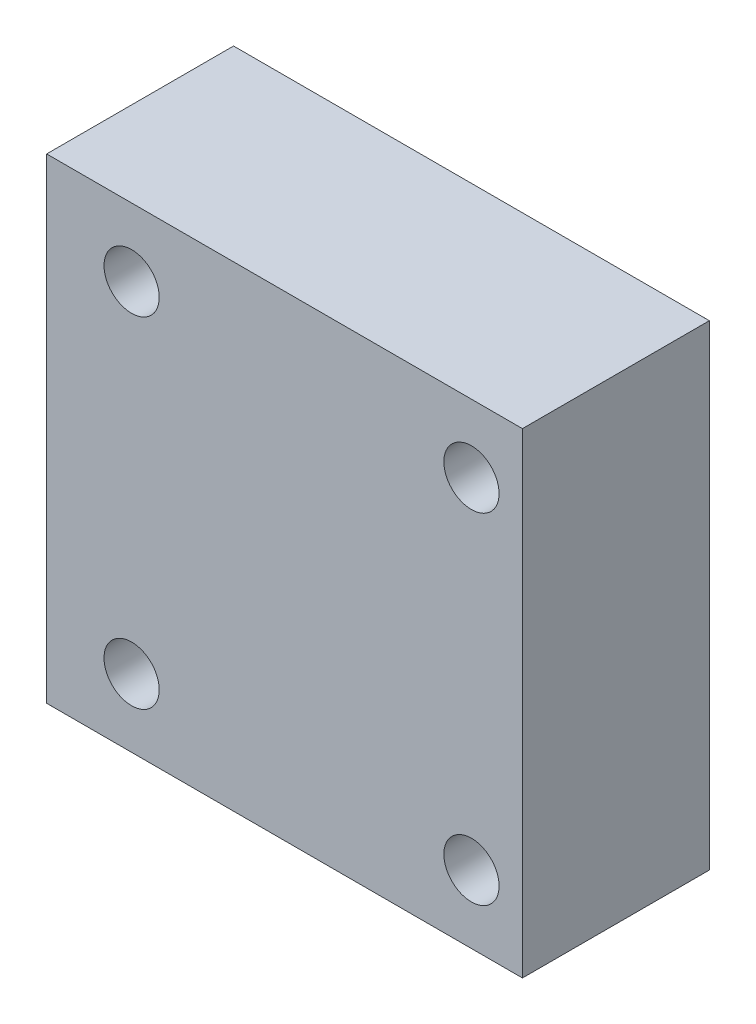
from build123d import *

# Parameters (mm, degrees)
SKETCH_1_W      = 56
SKETCH_1_H      = 56
SKETCH_1_R      = 3.25
EXTRUDE_1_DEPTH = 22


with BuildPart() as part:
    # Sketch 1 → Extrude 1 (new body)
    with BuildSketch(Plane.XY):
        with Locations((28, -28)):
            Rectangle(SKETCH_1_W, SKETCH_1_H)
        with Locations((10, -8)):
            Circle(SKETCH_1_R, mode=Mode.SUBTRACT)
        with Locations((50, -8)):
            Circle(SKETCH_1_R, mode=Mode.SUBTRACT)
        with Locations((50, -48)):
            Circle(SKETCH_1_R, mode=Mode.SUBTRACT)
        with Locations((10, -48)):
            Circle(SKETCH_1_R, mode=Mode.SUBTRACT)
    extrude(amount=EXTRUDE_1_DEPTH)


solid = part.part
